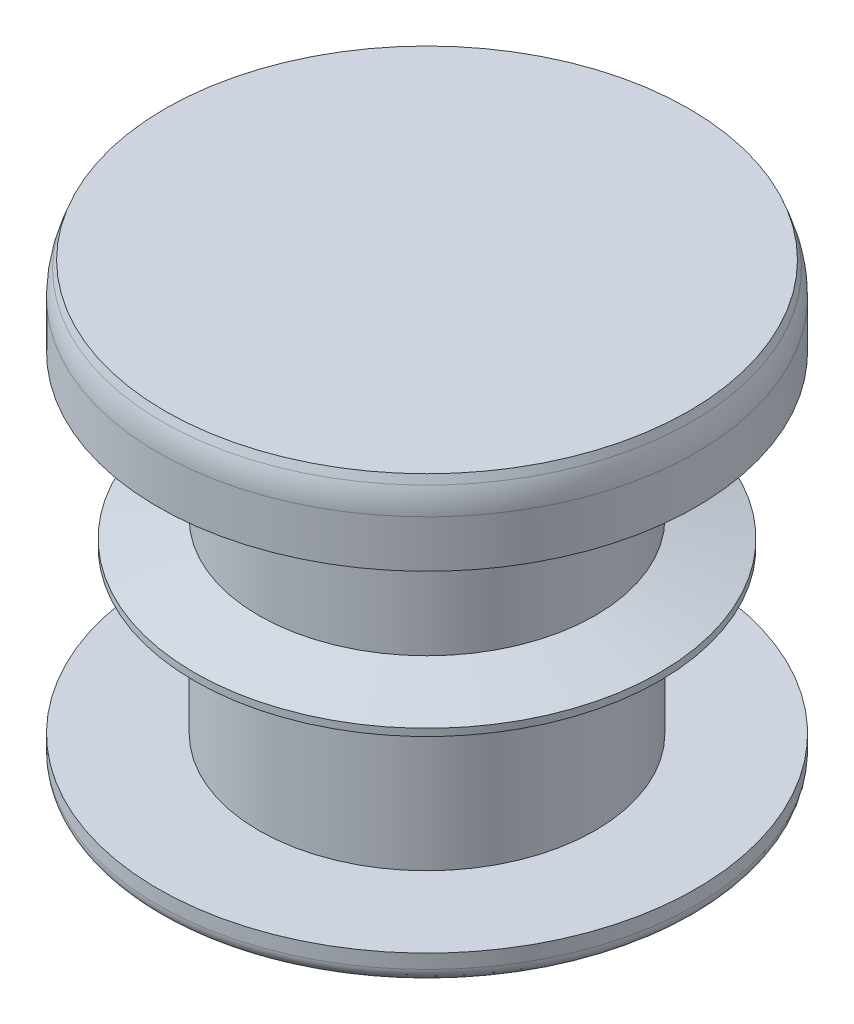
from build123d import *

# Parameters (mm, degrees)
FILLET1_R = 0.2
FILLET2_R = 1


with BuildPart() as part:
    # Sketch1 → Revolve1 (revolve)
    with BuildSketch(Plane.XY, mode=Mode.PRIVATE) as revolve1_sk:
        Polygon((0, 0), (0, -7.99956969), (0.5, -7.99956969), (3.76, -6.040764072), (3.76, -5.73), (2.35, -5.73), (2.35, -3.711154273), (3.25, -3.47), (3.25, -3.37), (2.35, -3.128845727), (2.35, -1.11), (3.76, -1.11), (3.76, -0.274747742), (3.66, 0), align=None)
    revolve(revolve1_sk.sketch.rotate(Axis((0, 0, 0), (0, -1, 0)), 180), axis=Axis((0, 0, 0), (0, -1, 0)))

    # Fillet1
    fillet1_edges = [part.edges().sort_by_distance(p)[0] for p in [
        (3.76, -6.040764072, 0),
    ]]
    fillet(fillet1_edges, radius=FILLET1_R)

    # Fillet2
    fillet2_edges = [part.edges().sort_by_distance(p)[0] for p in [
        (3.76, -0.274747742, 0),
    ]]
    fillet(fillet2_edges, radius=FILLET2_R)


solid = part.part
